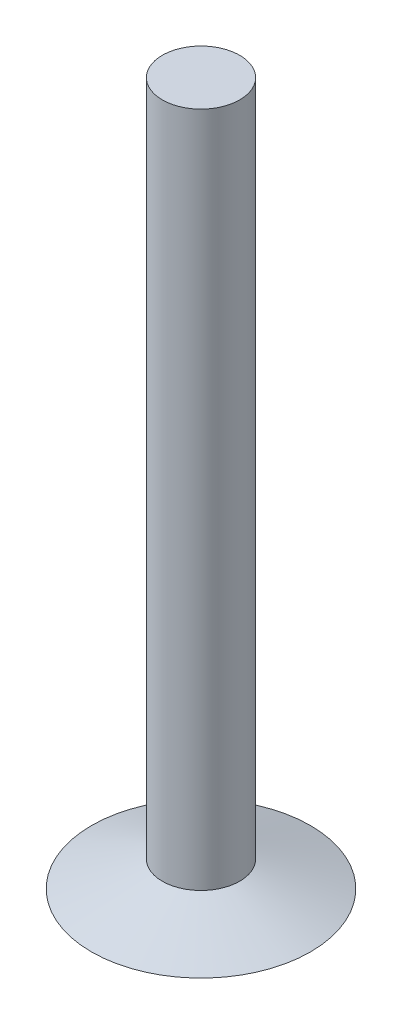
ISO-10303-21;
HEADER;
FILE_DESCRIPTION(('STEP AP214'),'2;1');
FILE_NAME('part.step','',(''),(''),'','','');
FILE_SCHEMA(('AUTOMOTIVE_DESIGN { 1 0 10303 214 1 1 1 1 }'));
ENDSEC;
DATA;
#1=APPLICATION_CONTEXT('core data for automotive mechanical design processes');
#2=APPLICATION_PROTOCOL_DEFINITION('international standard','automotive_design',2000,#1);
#3=PRODUCT_CONTEXT('',#1,'mechanical');
#4=PRODUCT('Part','Part','',(#3));
#5=PRODUCT_RELATED_PRODUCT_CATEGORY('part','',(#4));
#6=PRODUCT_DEFINITION_FORMATION('','',#4);
#7=PRODUCT_DEFINITION_CONTEXT('part definition',#1,'design');
#8=PRODUCT_DEFINITION('design','',#6,#7);
#9=PRODUCT_DEFINITION_SHAPE('','',#8);
#10=(LENGTH_UNIT() NAMED_UNIT(*) SI_UNIT(.MILLI.,.METRE.));
#11=(NAMED_UNIT(*) PLANE_ANGLE_UNIT() SI_UNIT($,.RADIAN.));
#12=(NAMED_UNIT(*) SI_UNIT($,.STERADIAN.) SOLID_ANGLE_UNIT());
#13=UNCERTAINTY_MEASURE_WITH_UNIT(LENGTH_MEASURE(1.E-05),#10,'distance_accuracy_value','');
#14=(GEOMETRIC_REPRESENTATION_CONTEXT(3) GLOBAL_UNCERTAINTY_ASSIGNED_CONTEXT((#13)) GLOBAL_UNIT_ASSIGNED_CONTEXT((#10,
#11,#12)) REPRESENTATION_CONTEXT('',''));
#15=CARTESIAN_POINT('',(0.,0.,0.));
#16=DIRECTION('',(0.,0.,1.));
#17=DIRECTION('',(1.,0.,0.));
#18=AXIS2_PLACEMENT_3D('',#15,#16,#17);
#19=CARTESIAN_POINT('',(0.,0.,0.));
#20=DIRECTION('',(0.,-1.,0.));
#21=DIRECTION('',(0.,0.,1.));
#22=AXIS2_PLACEMENT_3D('',#19,#20,#21);
#23=CONICAL_SURFACE('',#22,60.,1.22173047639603);
#24=CARTESIAN_POINT('',(0.,-40.,0.));
#25=DIRECTION('',(0.,1.,0.));
#26=DIRECTION('',(0.,0.,1.));
#27=AXIS2_PLACEMENT_3D('',#24,#25,#26);
#28=CIRCLE('',#27,169.899096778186);
#29=CARTESIAN_POINT('',(0.,-40.,169.899096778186));
#30=VERTEX_POINT('',#29);
#31=EDGE_CURVE('E10',#30,#30,#28,.T.);
#32=ORIENTED_EDGE('',*,*,#31,.T.);
#33=EDGE_LOOP('',(#32));
#34=FACE_BOUND('',#33,.T.);
#35=CARTESIAN_POINT('',(0.,0.,0.));
#36=DIRECTION('',(0.,1.,0.));
#37=DIRECTION('',(0.,0.,1.));
#38=AXIS2_PLACEMENT_3D('',#35,#36,#37);
#39=CIRCLE('',#38,60.);
#40=CARTESIAN_POINT('',(0.,0.,60.));
#41=VERTEX_POINT('',#40);
#42=EDGE_CURVE('E43',#41,#41,#39,.T.);
#43=ORIENTED_EDGE('',*,*,#42,.F.);
#44=EDGE_LOOP('',(#43));
#45=FACE_BOUND('',#44,.T.);
#46=ADVANCED_FACE('F37',(#34,#45),#23,.T.);
#47=CARTESIAN_POINT('',(0.,-40.,0.));
#48=DIRECTION('',(0.,1.,0.));
#49=DIRECTION('',(0.,0.,1.));
#50=AXIS2_PLACEMENT_3D('',#47,#48,#49);
#51=PLANE('',#50);
#52=ORIENTED_EDGE('',*,*,#31,.F.);
#53=EDGE_LOOP('',(#52));
#54=FACE_BOUND('',#53,.T.);
#55=ADVANCED_FACE('F58',(#54),#51,.F.);
#56=CARTESIAN_POINT('',(0.,1050.,0.));
#57=DIRECTION('',(0.,-1.,0.));
#58=DIRECTION('',(0.,0.,-1.));
#59=AXIS2_PLACEMENT_3D('',#56,#57,#58);
#60=CYLINDRICAL_SURFACE('',#59,60.);
#61=CARTESIAN_POINT('',(0.,1050.,0.));
#62=DIRECTION('',(0.,1.,0.));
#63=DIRECTION('',(0.,0.,1.));
#64=AXIS2_PLACEMENT_3D('',#61,#62,#63);
#65=CIRCLE('',#64,60.);
#66=CARTESIAN_POINT('',(0.,1050.,60.));
#67=VERTEX_POINT('',#66);
#68=EDGE_CURVE('E47',#67,#67,#65,.T.);
#69=ORIENTED_EDGE('',*,*,#68,.F.);
#70=EDGE_LOOP('',(#69));
#71=FACE_BOUND('',#70,.T.);
#72=ORIENTED_EDGE('',*,*,#42,.T.);
#73=EDGE_LOOP('',(#72));
#74=FACE_BOUND('',#73,.T.);
#75=ADVANCED_FACE('F56',(#71,#74),#60,.T.);
#76=CARTESIAN_POINT('',(0.,1050.,0.));
#77=DIRECTION('',(0.,1.,0.));
#78=DIRECTION('',(0.,0.,1.));
#79=AXIS2_PLACEMENT_3D('',#76,#77,#78);
#80=PLANE('',#79);
#81=ORIENTED_EDGE('',*,*,#68,.T.);
#82=EDGE_LOOP('',(#81));
#83=FACE_BOUND('',#82,.T.);
#84=ADVANCED_FACE('F54',(#83),#80,.T.);
#85=CLOSED_SHELL('',(#46,#55,#75,#84));
#86=MANIFOLD_SOLID_BREP('B2',#85);
#87=ADVANCED_BREP_SHAPE_REPRESENTATION('',(#18,#86),#14);
#88=SHAPE_DEFINITION_REPRESENTATION(#9,#87);
ENDSEC;
END-ISO-10303-21;
